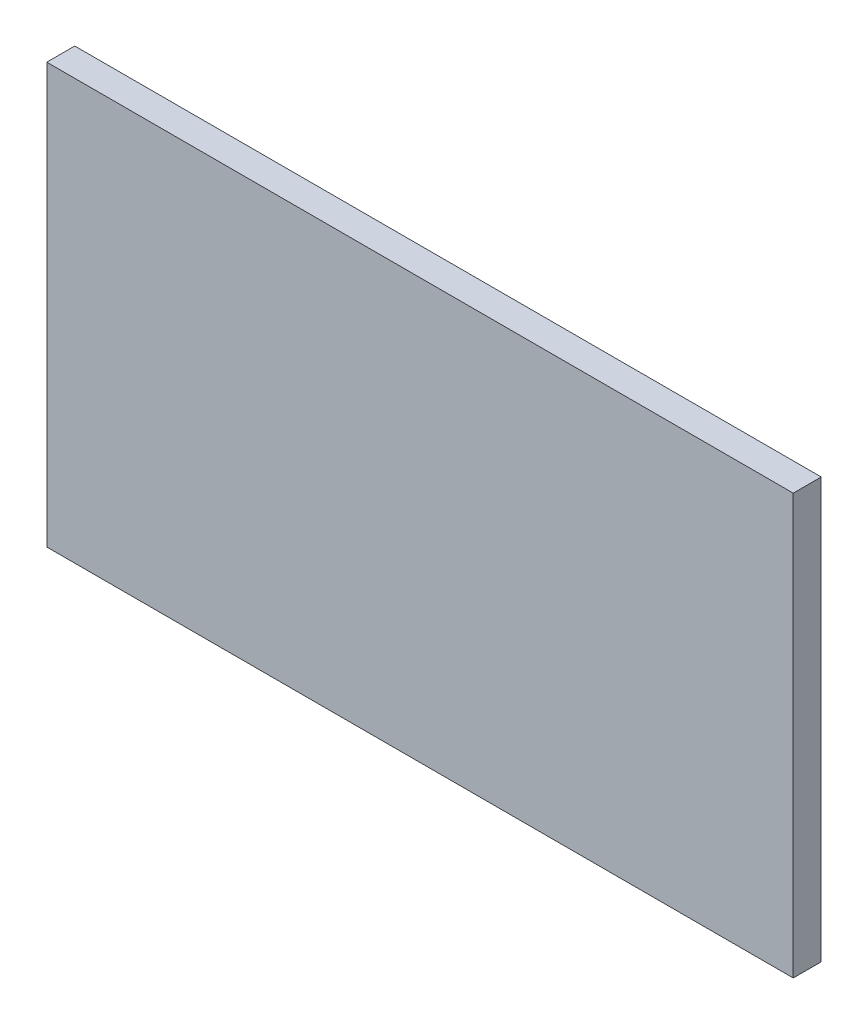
ISO-10303-21;
HEADER;
FILE_DESCRIPTION(('STEP AP214'),'2;1');
FILE_NAME('part.step','',(''),(''),'','','');
FILE_SCHEMA(('AUTOMOTIVE_DESIGN { 1 0 10303 214 1 1 1 1 }'));
ENDSEC;
DATA;
#1=APPLICATION_CONTEXT('core data for automotive mechanical design processes');
#2=APPLICATION_PROTOCOL_DEFINITION('international standard','automotive_design',2000,#1);
#3=PRODUCT_CONTEXT('',#1,'mechanical');
#4=PRODUCT('Part','Part','',(#3));
#5=PRODUCT_RELATED_PRODUCT_CATEGORY('part','',(#4));
#6=PRODUCT_DEFINITION_FORMATION('','',#4);
#7=PRODUCT_DEFINITION_CONTEXT('part definition',#1,'design');
#8=PRODUCT_DEFINITION('design','',#6,#7);
#9=PRODUCT_DEFINITION_SHAPE('','',#8);
#10=(LENGTH_UNIT() NAMED_UNIT(*) SI_UNIT(.MILLI.,.METRE.));
#11=(NAMED_UNIT(*) PLANE_ANGLE_UNIT() SI_UNIT($,.RADIAN.));
#12=(NAMED_UNIT(*) SI_UNIT($,.STERADIAN.) SOLID_ANGLE_UNIT());
#13=UNCERTAINTY_MEASURE_WITH_UNIT(LENGTH_MEASURE(1.E-05),#10,'distance_accuracy_value','');
#14=(GEOMETRIC_REPRESENTATION_CONTEXT(3) GLOBAL_UNCERTAINTY_ASSIGNED_CONTEXT((#13)) GLOBAL_UNIT_ASSIGNED_CONTEXT((#10,
#11,#12)) REPRESENTATION_CONTEXT('',''));
#15=CARTESIAN_POINT('',(0.,0.,0.));
#16=DIRECTION('',(0.,0.,1.));
#17=DIRECTION('',(1.,0.,0.));
#18=AXIS2_PLACEMENT_3D('',#15,#16,#17);
#19=CARTESIAN_POINT('',(0.,0.,6.));
#20=DIRECTION('',(1.,0.,0.));
#21=DIRECTION('',(0.,0.,-1.));
#22=AXIS2_PLACEMENT_3D('',#19,#20,#21);
#23=PLANE('',#22);
#24=DIRECTION('',(0.,-1.,0.));
#25=VECTOR('',#24,1.);
#26=CARTESIAN_POINT('',(0.,0.,0.));
#27=LINE('',#26,#25);
#28=CARTESIAN_POINT('',(0.,90.,0.));
#29=VERTEX_POINT('',#28);
#30=CARTESIAN_POINT('',(0.,0.,0.));
#31=VERTEX_POINT('',#30);
#32=EDGE_CURVE('E104',#29,#31,#27,.T.);
#33=ORIENTED_EDGE('',*,*,#32,.T.);
#34=DIRECTION('',(0.,0.,-1.));
#35=VECTOR('',#34,1.);
#36=CARTESIAN_POINT('',(0.,0.,6.));
#37=LINE('',#36,#35);
#38=CARTESIAN_POINT('',(0.,0.,6.));
#39=VERTEX_POINT('',#38);
#40=EDGE_CURVE('E11',#39,#31,#37,.T.);
#41=ORIENTED_EDGE('',*,*,#40,.F.);
#42=DIRECTION('',(0.,-1.,0.));
#43=VECTOR('',#42,1.);
#44=CARTESIAN_POINT('',(0.,0.,6.));
#45=LINE('',#44,#43);
#46=CARTESIAN_POINT('',(0.,90.,6.));
#47=VERTEX_POINT('',#46);
#48=EDGE_CURVE('E95',#47,#39,#45,.T.);
#49=ORIENTED_EDGE('',*,*,#48,.F.);
#50=DIRECTION('',(0.,0.,-1.));
#51=VECTOR('',#50,1.);
#52=CARTESIAN_POINT('',(0.,90.,6.));
#53=LINE('',#52,#51);
#54=EDGE_CURVE('E99',#47,#29,#53,.T.);
#55=ORIENTED_EDGE('',*,*,#54,.T.);
#56=EDGE_LOOP('',(#33,#41,#49,#55));
#57=FACE_BOUND('',#56,.T.);
#58=ADVANCED_FACE('F41',(#57),#23,.F.);
#59=CARTESIAN_POINT('',(0.,0.,6.));
#60=DIRECTION('',(0.,1.,0.));
#61=DIRECTION('',(0.,0.,1.));
#62=AXIS2_PLACEMENT_3D('',#59,#60,#61);
#63=PLANE('',#62);
#64=DIRECTION('',(1.,0.,0.));
#65=VECTOR('',#64,1.);
#66=CARTESIAN_POINT('',(0.,0.,0.));
#67=LINE('',#66,#65);
#68=CARTESIAN_POINT('',(160.,0.,0.));
#69=VERTEX_POINT('',#68);
#70=EDGE_CURVE('E98',#31,#69,#67,.T.);
#71=ORIENTED_EDGE('',*,*,#70,.T.);
#72=DIRECTION('',(0.,0.,-1.));
#73=VECTOR('',#72,1.);
#74=CARTESIAN_POINT('',(160.,0.,6.));
#75=LINE('',#74,#73);
#76=CARTESIAN_POINT('',(160.,0.,6.));
#77=VERTEX_POINT('',#76);
#78=EDGE_CURVE('E47',#77,#69,#75,.T.);
#79=ORIENTED_EDGE('',*,*,#78,.F.);
#80=DIRECTION('',(1.,0.,0.));
#81=VECTOR('',#80,1.);
#82=CARTESIAN_POINT('',(0.,0.,6.));
#83=LINE('',#82,#81);
#84=EDGE_CURVE('E90',#39,#77,#83,.T.);
#85=ORIENTED_EDGE('',*,*,#84,.F.);
#86=ORIENTED_EDGE('',*,*,#40,.T.);
#87=EDGE_LOOP('',(#71,#79,#85,#86));
#88=FACE_BOUND('',#87,.T.);
#89=ADVANCED_FACE('F91',(#88),#63,.F.);
#90=CARTESIAN_POINT('',(160.,0.,6.));
#91=DIRECTION('',(-1.,0.,0.));
#92=DIRECTION('',(0.,0.,1.));
#93=AXIS2_PLACEMENT_3D('',#90,#91,#92);
#94=PLANE('',#93);
#95=DIRECTION('',(0.,1.,0.));
#96=VECTOR('',#95,1.);
#97=CARTESIAN_POINT('',(160.,0.,0.));
#98=LINE('',#97,#96);
#99=CARTESIAN_POINT('',(160.,90.,0.));
#100=VERTEX_POINT('',#99);
#101=EDGE_CURVE('E74',#69,#100,#98,.T.);
#102=ORIENTED_EDGE('',*,*,#101,.T.);
#103=DIRECTION('',(0.,0.,-1.));
#104=VECTOR('',#103,1.);
#105=CARTESIAN_POINT('',(160.,90.,6.));
#106=LINE('',#105,#104);
#107=CARTESIAN_POINT('',(160.,90.,6.));
#108=VERTEX_POINT('',#107);
#109=EDGE_CURVE('E97',#108,#100,#106,.T.);
#110=ORIENTED_EDGE('',*,*,#109,.F.);
#111=DIRECTION('',(0.,1.,0.));
#112=VECTOR('',#111,1.);
#113=CARTESIAN_POINT('',(160.,0.,6.));
#114=LINE('',#113,#112);
#115=EDGE_CURVE('E89',#77,#108,#114,.T.);
#116=ORIENTED_EDGE('',*,*,#115,.F.);
#117=ORIENTED_EDGE('',*,*,#78,.T.);
#118=EDGE_LOOP('',(#102,#110,#116,#117));
#119=FACE_BOUND('',#118,.T.);
#120=ADVANCED_FACE('F96',(#119),#94,.F.);
#121=CARTESIAN_POINT('',(0.,90.,6.));
#122=DIRECTION('',(0.,-1.,0.));
#123=DIRECTION('',(0.,0.,-1.));
#124=AXIS2_PLACEMENT_3D('',#121,#122,#123);
#125=PLANE('',#124);
#126=DIRECTION('',(-1.,0.,0.));
#127=VECTOR('',#126,1.);
#128=CARTESIAN_POINT('',(0.,90.,0.));
#129=LINE('',#128,#127);
#130=EDGE_CURVE('E78',#100,#29,#129,.T.);
#131=ORIENTED_EDGE('',*,*,#130,.T.);
#132=ORIENTED_EDGE('',*,*,#54,.F.);
#133=DIRECTION('',(-1.,0.,0.));
#134=VECTOR('',#133,1.);
#135=CARTESIAN_POINT('',(0.,90.,6.));
#136=LINE('',#135,#134);
#137=EDGE_CURVE('E60',#108,#47,#136,.T.);
#138=ORIENTED_EDGE('',*,*,#137,.F.);
#139=ORIENTED_EDGE('',*,*,#109,.T.);
#140=EDGE_LOOP('',(#131,#132,#138,#139));
#141=FACE_BOUND('',#140,.T.);
#142=ADVANCED_FACE('F111',(#141),#125,.F.);
#143=CARTESIAN_POINT('',(0.,0.,6.));
#144=DIRECTION('',(0.,0.,-1.));
#145=DIRECTION('',(-1.,0.,0.));
#146=AXIS2_PLACEMENT_3D('',#143,#144,#145);
#147=PLANE('',#146);
#148=ORIENTED_EDGE('',*,*,#48,.T.);
#149=ORIENTED_EDGE('',*,*,#84,.T.);
#150=ORIENTED_EDGE('',*,*,#115,.T.);
#151=ORIENTED_EDGE('',*,*,#137,.T.);
#152=EDGE_LOOP('',(#148,#149,#150,#151));
#153=FACE_BOUND('',#152,.T.);
#154=ADVANCED_FACE('F87',(#153),#147,.F.);
#155=CARTESIAN_POINT('',(0.,0.,0.));
#156=DIRECTION('',(0.,0.,-1.));
#157=DIRECTION('',(-1.,0.,0.));
#158=AXIS2_PLACEMENT_3D('',#155,#156,#157);
#159=PLANE('',#158);
#160=ORIENTED_EDGE('',*,*,#32,.F.);
#161=ORIENTED_EDGE('',*,*,#130,.F.);
#162=ORIENTED_EDGE('',*,*,#101,.F.);
#163=ORIENTED_EDGE('',*,*,#70,.F.);
#164=EDGE_LOOP('',(#160,#161,#162,#163));
#165=FACE_BOUND('',#164,.T.);
#166=ADVANCED_FACE('F112',(#165),#159,.T.);
#167=CLOSED_SHELL('',(#58,#89,#120,#142,#154,#166));
#168=MANIFOLD_SOLID_BREP('B2',#167);
#169=ADVANCED_BREP_SHAPE_REPRESENTATION('',(#18,#168),#14);
#170=SHAPE_DEFINITION_REPRESENTATION(#9,#169);
ENDSEC;
END-ISO-10303-21;
